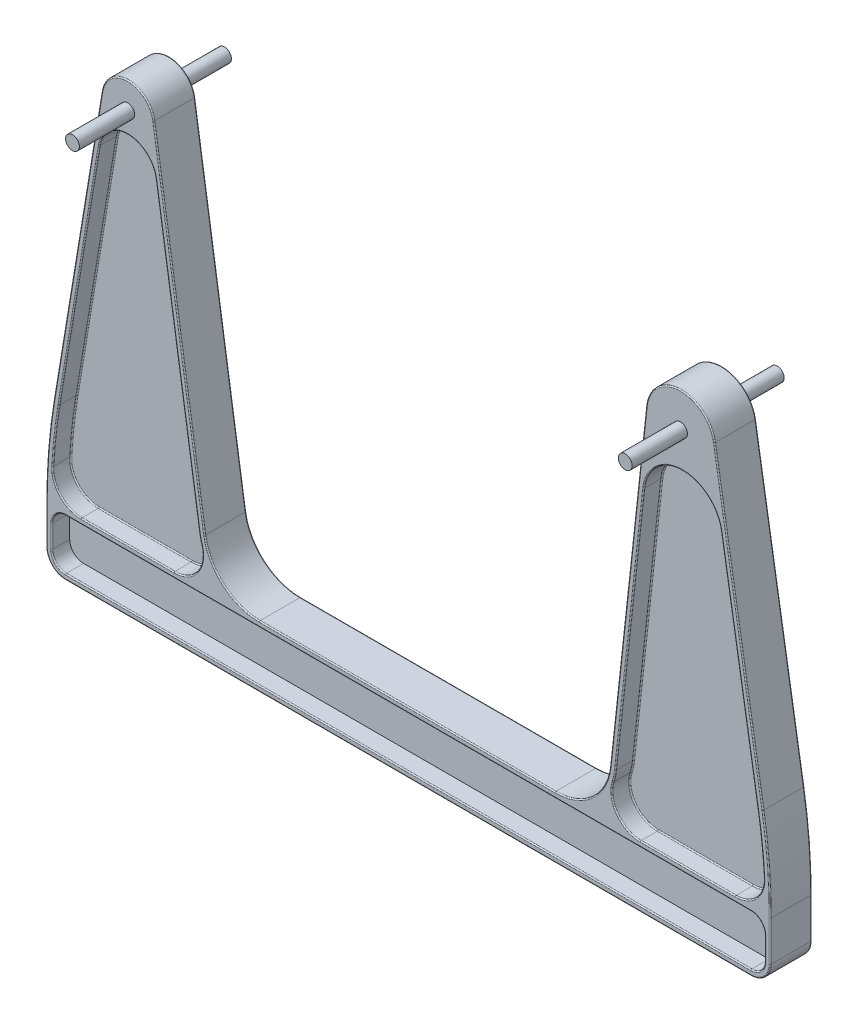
from build123d import *

# Parameters (mm, degrees)
EXTRUDE1_DEPTH     = 150
SKETCH1_3_R        = 12.5
EXTRUDE2_DEPTH     = 37.5
SKETCH1_4_R        = 12.5
EXTRUDE3_DEPTH     = 137.5
SKETCH2_W          = 1928.158782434
SKETCH2_H          = 904.857327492
EXTRUDE4_DEPTH     = 1087.812950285
CUT_EXTRUDE1_DEPTH = 32.5
FILLET1_R          = 35
FILLET2_R          = 2


with BuildPart() as part:
    # Sketch1 → Extrude1 (new, symmetric)
    with BuildSketch(Plane.XY):
        Polygon((-655, 58.243881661), (-655, -100), (-635, -100), (-635, 0), (-225, 0), (-225, -100), (-205, -100), (-205, 0), (205, 0), (205, -100), (225, -100), (225, 0), (635, 0), (635, -100), (655, -100), (655, 58.243881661), align=None)
    extrude(amount=EXTRUDE1_DEPTH, both=True)

    # Sketch1_3 → Extrude2 (add, symmetric)
    with BuildSketch(Plane.XY):
        with BuildLine():
            Line((-655, 165.603834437), (-655, 58.243881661))
            Line((-655, 58.243881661), (655, 58.243881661))
            Line((655, 58.243881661), (655, 165.603834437))
            ThreePointArc((655, 165.603834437), (651.672716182, 247.11148327), (641.713006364, 328.07673394))
            Line((641.713006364, 328.07673394), (554.102493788, 860.143512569))
            ThreePointArc((554.102493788, 860.143512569), (490.805527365, 912.409028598), (430.437854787, 856.78588385))
            Line((430.437854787, 856.78588385), (365.035487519, 258.630757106))
            ThreePointArc((365.035487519, 258.630757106), (332.385252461, 195.045564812), (265.627943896, 169.49999217))
            Line((265.627943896, 169.49999217), (-269.414878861, 169.49999217))
            ThreePointArc((-269.414878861, 169.49999217), (-334.564291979, 193.634624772), (-368.2665621, 254.388912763))
            Line((-368.2665621, 254.388912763), (-460.415625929, 857.197608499))
            ThreePointArc((-460.415625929, 857.197608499), (-507.226015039, 897.630544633), (-554.498455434, 857.738800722))
            Line((-554.498455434, 857.738800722), (-641.713006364, 328.07673394))
            ThreePointArc((-641.713006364, 328.07673394), (-651.672716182, 247.11148327), (-655, 165.603834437))
        make_face()
        with Locations((-507.5, 850)):
            Circle(SKETCH1_3_R, mode=Mode.SUBTRACT)
        with Locations((492.5, 850)):
            Circle(SKETCH1_3_R, mode=Mode.SUBTRACT)
    extrude(amount=EXTRUDE2_DEPTH, both=True)

    # Sketch1_4 → Extrude3 (add, symmetric)
    with BuildSketch(Plane.XY):
        with Locations((492.5, 850)):
            Circle(SKETCH1_4_R)
        with Locations((-507.5, 850)):
            Circle(SKETCH1_4_R)
    extrude(amount=EXTRUDE3_DEPTH, both=True)

    # Sketch2 → Extrude4 (cut, through all)
    with BuildSketch(Plane(origin=(0, 58.243881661, 0), x_dir=(1, 0, 0), z_dir=(0, 1, 0))):
        with Locations((0, 13.950470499)):
            Rectangle(SKETCH2_W, SKETCH2_H)
    extrude(amount=-EXTRUDE4_DEPTH, mode=Mode.SUBTRACT)

    # Sketch3 → Cut-Extrude1 (cut)
    with BuildSketch(Plane.XY.offset(37.5)):
        with BuildLine():
            Line((-591.729493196, 169.49999217), (-423.632622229, 169.49999217))
            ThreePointArc((-423.632622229, 169.49999217), (-382.021373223, 190.568388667), (-374.372643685, 236.577847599))
            ThreePointArc((-374.372643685, 236.577847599), (-376.572563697, 244.655866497), (-378.151730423, 252.877804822))
            Line((-378.151730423, 252.877804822), (-456.979805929, 768.545001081))
            ThreePointArc((-456.979805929, 768.545001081), (-507.716462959, 812.369289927), (-558.953926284, 769.13158634))
            Line((-558.953926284, 769.13158634), (-631.8458763, 326.452004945))
            ThreePointArc((-631.8458763, 326.452004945), (-638.885416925, 275.465048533), (-643.265500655, 224.181135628))
            ThreePointArc((-643.265500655, 224.181135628), (-629.299386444, 185.717492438), (-591.729493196, 169.49999217))
        make_face()
        with BuildLine():
            Line((645, 93.243881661), (645, 134.49999217))
            ThreePointArc((645, 134.49999217), (637.67766953, 152.177661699), (620, 159.49999217))
            Line((620, 159.49999217), (-620, 159.49999217))
            ThreePointArc((-620, 159.49999217), (-637.67766953, 152.177661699), (-645, 134.49999217))
            Line((-645, 134.49999217), (-645, 93.243881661))
            ThreePointArc((-645, 93.243881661), (-637.67766953, 75.566212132), (-620, 68.243881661))
            Line((-620, 68.243881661), (620, 68.243881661))
            ThreePointArc((620, 68.243881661), (637.67766953, 75.566212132), (645, 93.243881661))
        make_face()
        with BuildLine():
            ThreePointArc((370.58570872, 236.577847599), (373.292540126, 246.953712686), (374.976241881, 257.5438336))
            Line((374.976241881, 257.5438336), (426.068173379, 724.818980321))
            ThreePointArc((426.068173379, 724.818980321), (494.194472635, 787.590971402), (565.626546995, 728.608141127))
            Line((565.626546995, 728.608141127), (631.8458763, 326.452004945))
            ThreePointArc((631.8458763, 326.452004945), (638.885416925, 275.465048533), (643.265500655, 224.181135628))
            ThreePointArc((643.265500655, 224.181135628), (629.299386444, 185.717492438), (591.729493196, 169.49999217))
            Line((591.729493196, 169.49999217), (419.845687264, 169.49999217))
            ThreePointArc((419.845687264, 169.49999217), (378.234438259, 190.568388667), (370.58570872, 236.577847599))
        make_face()
    cut_extrude1 = extrude(amount=-CUT_EXTRUDE1_DEPTH, mode=Mode.SUBTRACT)

    # Mirror1: Cut-Extrude1 across plane
    add(cut_extrude1.mirror(Plane.XY), mode=Mode.SUBTRACT)

    # Fillet1
    fillet1_edges = [part.edges().sort_by_distance(p)[0] for p in [
        (-655, 58.243881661, 0),
        (655, 58.243881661, 0),
    ]]
    fillet(fillet1_edges, radius=FILLET1_R)

    # Fillet2
    fillet2_edges = [part.edges().sort_by_distance(p)[0] for p in [
        (-638.885416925, 275.465048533, 5),
        (-595.399901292, 547.791795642, 5),
        (-507.716462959, 812.369289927, 5),
        (-417.565768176, 510.711402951, 5),
        (-382.021373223, 190.568388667, 5),
        (-507.681057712, 169.49999217, 5),
        (373.292540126, 246.953712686, -37.5),
        (400.52220763, 491.18140696, -37.5),
        (494.194472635, 787.590971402, -37.5),
        (598.736211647, 527.530073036, -37.5),
        (638.885416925, 275.465048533, -37.5),
        (629.299386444, 185.717492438, -37.5),
        (505.78759023, 169.49999217, -37.5),
        (645, 113.871936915, -37.5),
        (637.67766953, 75.566212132, -37.5),
        (0, 68.243881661, -37.5),
        (-637.67766953, 75.566212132, -37.5),
        (-637.67766953, 152.177661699, -37.5),
        (0, 159.49999217, -37.5),
        (637.67766953, 152.177661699, -37.5),
        (-376.572563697, 244.655866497, -37.5),
        (-382.021373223, 190.568388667, -37.5),
        (-507.681057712, 169.49999217, -37.5),
        (-629.299386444, 185.717492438, -37.5),
        (-638.885416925, 275.465048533, -37.5),
        (-595.399901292, 547.791795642, -37.5),
        (-507.716462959, 812.369289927, -37.5),
        (-417.565768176, 510.711402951, -37.5),
        (373.292540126, 246.953712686, 37.5),
        (378.234438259, 190.568388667, 37.5),
        (505.78759023, 169.49999217, 37.5),
        (629.299386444, 185.717492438, 37.5),
        (638.885416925, 275.465048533, 37.5),
        (598.736211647, 527.530073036, 37.5),
        (494.194472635, 787.590971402, 37.5),
        (400.52220763, 491.18140696, 37.5),
        (645, 113.871936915, 37.5),
        (0, 159.49999217, 37.5),
        (0, 68.243881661, 37.5),
        (-376.572563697, 244.655866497, 37.5),
        (-417.565768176, 510.711402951, 37.5),
        (-507.716462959, 812.369289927, 37.5),
        (-595.399901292, 547.791795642, 37.5),
        (-638.885416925, 275.465048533, 37.5),
        (-507.681057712, 169.49999217, 37.5),
        (-382.021373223, 190.568388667, 37.5),
        (-651.672716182, 247.11148327, -37.5),
        (-655, 129.423858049, -37.5),
        (0, 58.243881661, -37.5),
        (490.805527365, 912.409028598, -37.5),
        (397.736671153, 557.708320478, -37.5),
        (-1.893467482, 169.49999217, -37.5),
        (-334.564291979, 193.634624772, -37.5),
        (-414.341094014, 555.793260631, -37.5),
        (-507.226015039, 897.630544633, -37.5),
        (-598.105730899, 592.907767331, -37.5),
        (-651.672716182, 247.11148327, 37.5),
        (-655, 129.423858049, 37.5),
        (0, 58.243881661, 37.5),
        (651.672716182, 247.11148327, 37.5),
        (597.907750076, 594.110123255, 37.5),
        (490.805527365, 912.409028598, 37.5),
        (397.736671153, 557.708320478, 37.5),
        (332.385252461, 195.045564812, 37.5),
        (-1.893467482, 169.49999217, 37.5),
        (-334.564291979, 193.634624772, 37.5),
        (-414.341094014, 555.793260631, 37.5),
        (-507.226015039, 897.630544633, 37.5),
        (-598.105730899, 592.907767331, 37.5),
        (-644.748737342, 68.49514432, -37.5),
        (644.748737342, 68.49514432, 37.5),
        (-645, 113.871936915, 37.5),
        (-629.299386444, 185.717492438, 5),
        (-629.299386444, 185.717492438, 37.5),
        (-638.885416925, 275.465048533, -5),
        (-507.716462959, 812.369289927, -5),
        (-417.565768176, 510.711402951, -5),
        (-376.572563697, 244.655866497, -5),
        (-382.021373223, 190.568388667, -5),
        (-507.681057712, 169.49999217, -5),
        (373.292540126, 246.953712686, -5),
        (400.52220763, 491.18140696, -5),
        (598.736211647, 527.530073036, -5),
        (638.885416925, 275.465048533, -5),
        (629.299386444, 185.717492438, -5),
        (505.78759023, 169.49999217, -5),
        (-645, 113.871936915, -5),
        (-637.67766953, 152.177661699, -5),
        (0, 159.49999217, -5),
        (645, 113.871936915, -5),
        (637.67766953, 75.566212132, -5),
        (400.52220763, 491.18140696, 5),
        (494.194472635, 787.590971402, 5),
        (598.736211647, 527.530073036, 5),
        (638.885416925, 275.465048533, 5),
        (505.78759023, 169.49999217, 5),
        (-629.299386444, 185.717492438, -5),
        (378.234438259, 190.568388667, -5),
        (378.234438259, 190.568388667, 5),
    ]]
    fillet(fillet2_edges, radius=FILLET2_R)


solid = part.part
